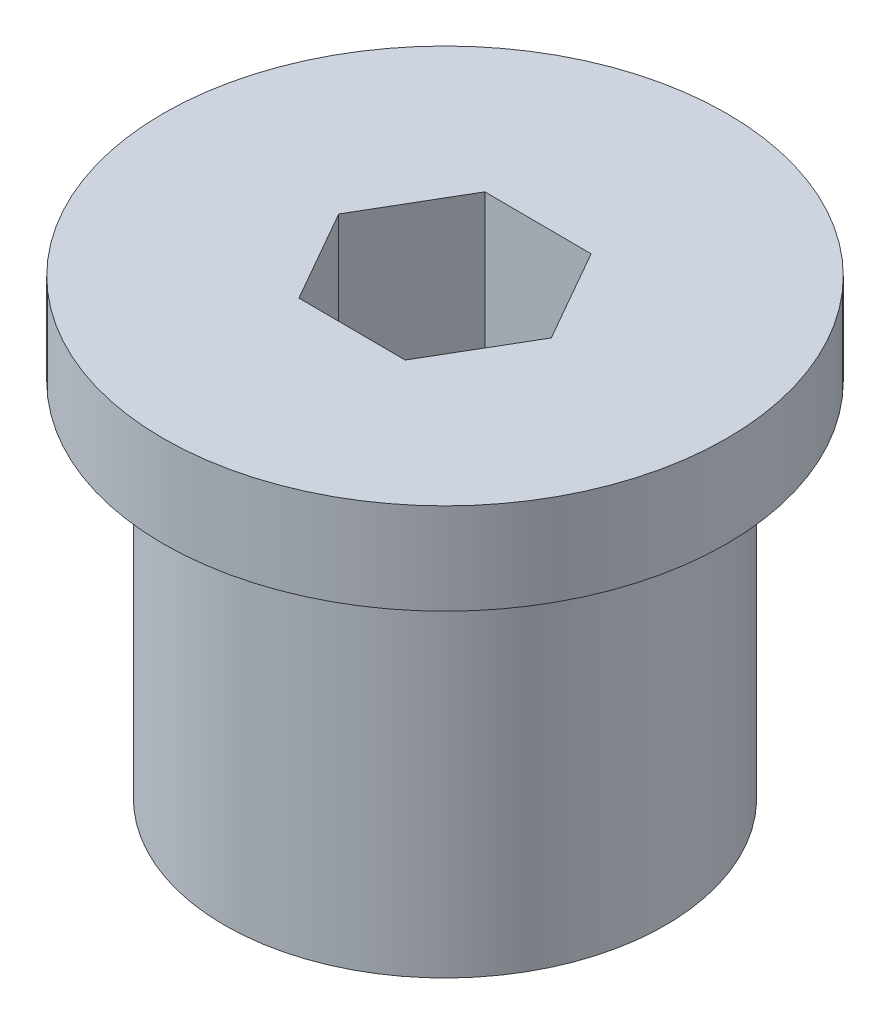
from build123d import *

# Parameters (mm, degrees)
EXTRUDE1_DEPTH = 6


with BuildPart() as part:
    # Sketch1 → Revolve1 (revolve)
    with BuildSketch(Plane.XY, mode=Mode.PRIVATE) as revolve1_sk:
        Polygon((0, 0), (-5.55625, 0), (-5.55625, 9.1), (-7.1, 9.1), (-7.1, 11.4), (0, 11.4), align=None)
    revolve(revolve1_sk.sketch.rotate(Axis((0, 0, 0), (0, 1, 0)), 270), axis=Axis((0, 0, 0), (0, 1, 0)))

    # Sketch2 → Extrude1 (cut)
    with BuildSketch(Plane(origin=(0, 11.4, 0), x_dir=(1, 0, 0), z_dir=(0, 1, 0))):
        Polygon((2.692681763, -0.013791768), (1.358284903, 2.325034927), (-1.33439686, 2.338826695), (-2.692681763, 0.013791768), (-1.358284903, -2.325034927), (1.33439686, -2.338826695), align=None)
    extrude(amount=-EXTRUDE1_DEPTH, mode=Mode.SUBTRACT)


solid = part.part
